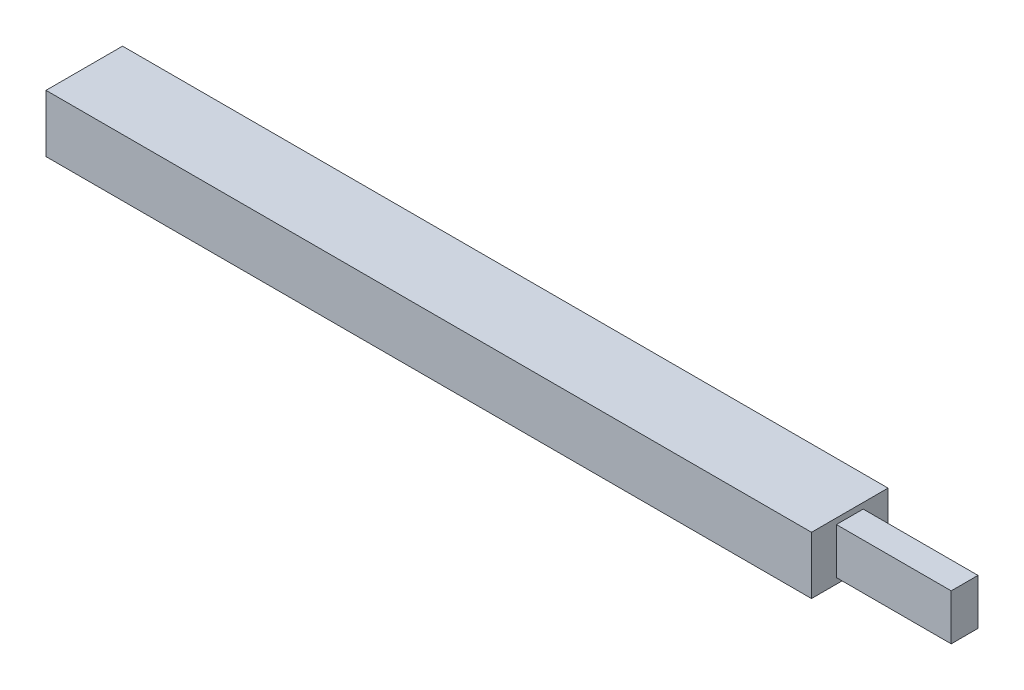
from build123d import *

# Parameters (mm, degrees)
SKETCH1_W           = 200
SKETCH1_H           = 20
BOSS_EXTRUDE1_DEPTH = 15
SKETCH2_W           = 7
SKETCH2_H           = 12
BOSS_EXTRUDE2_DEPTH = 30


with BuildPart() as part:
    # Sketch1 → Boss-Extrude1 (new body)
    with BuildSketch(Plane(origin=(0, 0, 0), x_dir=(1, 0, 0), z_dir=(0, 1, 0))):
        Rectangle(SKETCH1_W, SKETCH1_H)
    extrude(amount=BOSS_EXTRUDE1_DEPTH)

    # Sketch2 → Boss-Extrude2 (add)
    with BuildSketch(Plane(origin=(100, 0, 0), x_dir=(0, 0, -1), z_dir=(1, 0, 0))):
        with Locations((0, 7.5)):
            Rectangle(SKETCH2_W, SKETCH2_H)
    extrude(amount=BOSS_EXTRUDE2_DEPTH)


solid = part.part
